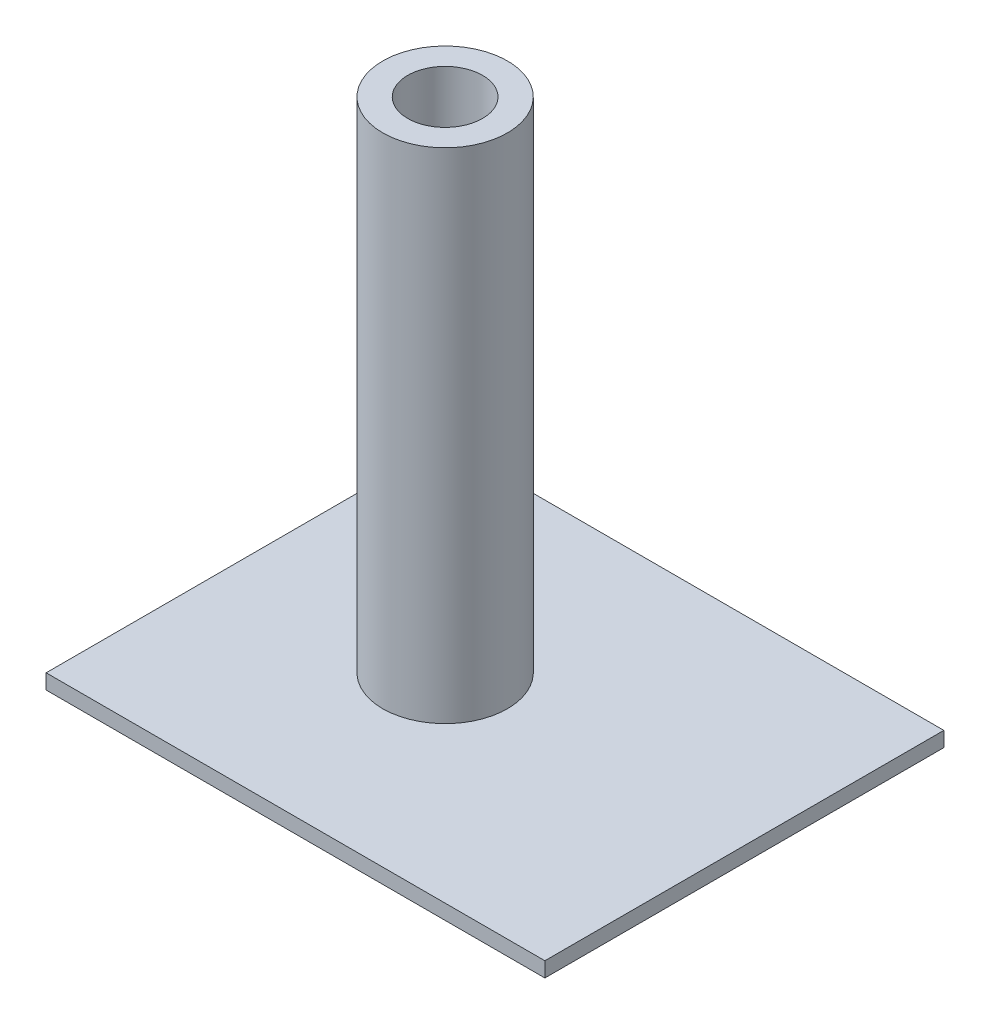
ISO-10303-21;
HEADER;
FILE_DESCRIPTION(('STEP AP214'),'2;1');
FILE_NAME('part.step','',(''),(''),'','','');
FILE_SCHEMA(('AUTOMOTIVE_DESIGN { 1 0 10303 214 1 1 1 1 }'));
ENDSEC;
DATA;
#1=APPLICATION_CONTEXT('core data for automotive mechanical design processes');
#2=APPLICATION_PROTOCOL_DEFINITION('international standard','automotive_design',2000,#1);
#3=PRODUCT_CONTEXT('',#1,'mechanical');
#4=PRODUCT('Part','Part','',(#3));
#5=PRODUCT_RELATED_PRODUCT_CATEGORY('part','',(#4));
#6=PRODUCT_DEFINITION_FORMATION('','',#4);
#7=PRODUCT_DEFINITION_CONTEXT('part definition',#1,'design');
#8=PRODUCT_DEFINITION('design','',#6,#7);
#9=PRODUCT_DEFINITION_SHAPE('','',#8);
#10=(LENGTH_UNIT() NAMED_UNIT(*) SI_UNIT(.MILLI.,.METRE.));
#11=(NAMED_UNIT(*) PLANE_ANGLE_UNIT() SI_UNIT($,.RADIAN.));
#12=(NAMED_UNIT(*) SI_UNIT($,.STERADIAN.) SOLID_ANGLE_UNIT());
#13=UNCERTAINTY_MEASURE_WITH_UNIT(LENGTH_MEASURE(1.E-05),#10,'distance_accuracy_value','');
#14=(GEOMETRIC_REPRESENTATION_CONTEXT(3) GLOBAL_UNCERTAINTY_ASSIGNED_CONTEXT((#13)) GLOBAL_UNIT_ASSIGNED_CONTEXT((#10,
#11,#12)) REPRESENTATION_CONTEXT('',''));
#15=CARTESIAN_POINT('',(0.,0.,0.));
#16=DIRECTION('',(0.,0.,1.));
#17=DIRECTION('',(1.,0.,0.));
#18=AXIS2_PLACEMENT_3D('',#15,#16,#17);
#19=CARTESIAN_POINT('',(0.,0.,0.));
#20=DIRECTION('',(0.,1.,0.));
#21=DIRECTION('',(0.,0.,1.));
#22=AXIS2_PLACEMENT_3D('',#19,#20,#21);
#23=PLANE('',#22);
#24=DIRECTION('',(0.,0.,1.));
#25=VECTOR('',#24,1.);
#26=CARTESIAN_POINT('',(-50.,0.,-40.));
#27=LINE('',#26,#25);
#28=CARTESIAN_POINT('',(-50.,0.,-40.));
#29=VERTEX_POINT('',#28);
#30=CARTESIAN_POINT('',(-50.,0.,40.));
#31=VERTEX_POINT('',#30);
#32=EDGE_CURVE('E108',#29,#31,#27,.T.);
#33=ORIENTED_EDGE('',*,*,#32,.T.);
#34=DIRECTION('',(1.,0.,0.));
#35=VECTOR('',#34,1.);
#36=CARTESIAN_POINT('',(-50.,0.,40.));
#37=LINE('',#36,#35);
#38=CARTESIAN_POINT('',(50.,0.,40.));
#39=VERTEX_POINT('',#38);
#40=EDGE_CURVE('E111',#31,#39,#37,.T.);
#41=ORIENTED_EDGE('',*,*,#40,.T.);
#42=DIRECTION('',(0.,0.,1.));
#43=VECTOR('',#42,1.);
#44=CARTESIAN_POINT('',(50.,0.,-40.));
#45=LINE('',#44,#43);
#46=CARTESIAN_POINT('',(50.,0.,-40.));
#47=VERTEX_POINT('',#46);
#48=EDGE_CURVE('E97',#47,#39,#45,.T.);
#49=ORIENTED_EDGE('',*,*,#48,.F.);
#50=DIRECTION('',(1.,0.,0.));
#51=VECTOR('',#50,1.);
#52=CARTESIAN_POINT('',(-50.,0.,-40.));
#53=LINE('',#52,#51);
#54=EDGE_CURVE('E72',#29,#47,#53,.T.);
#55=ORIENTED_EDGE('',*,*,#54,.F.);
#56=EDGE_LOOP('',(#33,#41,#49,#55));
#57=FACE_BOUND('',#56,.T.);
#58=CARTESIAN_POINT('',(-9.99999999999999,0.,0.));
#59=DIRECTION('',(0.,1.,0.));
#60=DIRECTION('',(0.,0.,1.));
#61=AXIS2_PLACEMENT_3D('',#58,#59,#60);
#62=CIRCLE('',#61,12.5);
#63=CARTESIAN_POINT('',(-9.99999999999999,0.,12.5));
#64=VERTEX_POINT('',#63);
#65=EDGE_CURVE('E124',#64,#64,#62,.T.);
#66=ORIENTED_EDGE('',*,*,#65,.F.);
#67=EDGE_LOOP('',(#66));
#68=FACE_BOUND('',#67,.T.);
#69=ADVANCED_FACE('F39',(#57,#68),#23,.T.);
#70=CARTESIAN_POINT('',(-50.,-3.,-40.));
#71=DIRECTION('',(-1.,0.,0.));
#72=DIRECTION('',(0.,0.,1.));
#73=AXIS2_PLACEMENT_3D('',#70,#71,#72);
#74=PLANE('',#73);
#75=ORIENTED_EDGE('',*,*,#32,.F.);
#76=DIRECTION('',(0.,1.,0.));
#77=VECTOR('',#76,1.);
#78=CARTESIAN_POINT('',(-50.,-3.,-40.));
#79=LINE('',#78,#77);
#80=CARTESIAN_POINT('',(-50.,-3.,-40.));
#81=VERTEX_POINT('',#80);
#82=EDGE_CURVE('E48',#81,#29,#79,.T.);
#83=ORIENTED_EDGE('',*,*,#82,.F.);
#84=DIRECTION('',(0.,0.,1.));
#85=VECTOR('',#84,1.);
#86=CARTESIAN_POINT('',(-50.,-3.,-40.));
#87=LINE('',#86,#85);
#88=CARTESIAN_POINT('',(-50.,-3.,40.));
#89=VERTEX_POINT('',#88);
#90=EDGE_CURVE('E102',#81,#89,#87,.T.);
#91=ORIENTED_EDGE('',*,*,#90,.T.);
#92=DIRECTION('',(0.,1.,0.));
#93=VECTOR('',#92,1.);
#94=CARTESIAN_POINT('',(-50.,-3.,40.));
#95=LINE('',#94,#93);
#96=EDGE_CURVE('E80',#89,#31,#95,.T.);
#97=ORIENTED_EDGE('',*,*,#96,.T.);
#98=EDGE_LOOP('',(#75,#83,#91,#97));
#99=FACE_BOUND('',#98,.T.);
#100=ADVANCED_FACE('F41',(#99),#74,.T.);
#101=CARTESIAN_POINT('',(-50.,-3.,-40.));
#102=DIRECTION('',(0.,0.,1.));
#103=DIRECTION('',(1.,0.,0.));
#104=AXIS2_PLACEMENT_3D('',#101,#102,#103);
#105=PLANE('',#104);
#106=ORIENTED_EDGE('',*,*,#54,.T.);
#107=DIRECTION('',(0.,1.,0.));
#108=VECTOR('',#107,1.);
#109=CARTESIAN_POINT('',(50.,-3.,-40.));
#110=LINE('',#109,#108);
#111=CARTESIAN_POINT('',(50.,-3.,-40.));
#112=VERTEX_POINT('',#111);
#113=EDGE_CURVE('E99',#112,#47,#110,.T.);
#114=ORIENTED_EDGE('',*,*,#113,.F.);
#115=DIRECTION('',(1.,0.,0.));
#116=VECTOR('',#115,1.);
#117=CARTESIAN_POINT('',(-50.,-3.,-40.));
#118=LINE('',#117,#116);
#119=EDGE_CURVE('E90',#81,#112,#118,.T.);
#120=ORIENTED_EDGE('',*,*,#119,.F.);
#121=ORIENTED_EDGE('',*,*,#82,.T.);
#122=EDGE_LOOP('',(#106,#114,#120,#121));
#123=FACE_BOUND('',#122,.T.);
#124=ADVANCED_FACE('F152',(#123),#105,.F.);
#125=CARTESIAN_POINT('',(50.,-3.,-40.));
#126=DIRECTION('',(-1.,0.,0.));
#127=DIRECTION('',(0.,0.,1.));
#128=AXIS2_PLACEMENT_3D('',#125,#126,#127);
#129=PLANE('',#128);
#130=ORIENTED_EDGE('',*,*,#48,.T.);
#131=DIRECTION('',(0.,1.,0.));
#132=VECTOR('',#131,1.);
#133=CARTESIAN_POINT('',(50.,-3.,40.));
#134=LINE('',#133,#132);
#135=CARTESIAN_POINT('',(50.,-3.,40.));
#136=VERTEX_POINT('',#135);
#137=EDGE_CURVE('E94',#136,#39,#134,.T.);
#138=ORIENTED_EDGE('',*,*,#137,.F.);
#139=DIRECTION('',(0.,0.,1.));
#140=VECTOR('',#139,1.);
#141=CARTESIAN_POINT('',(50.,-3.,-40.));
#142=LINE('',#141,#140);
#143=EDGE_CURVE('E85',#112,#136,#142,.T.);
#144=ORIENTED_EDGE('',*,*,#143,.F.);
#145=ORIENTED_EDGE('',*,*,#113,.T.);
#146=EDGE_LOOP('',(#130,#138,#144,#145));
#147=FACE_BOUND('',#146,.T.);
#148=ADVANCED_FACE('F95',(#147),#129,.F.);
#149=CARTESIAN_POINT('',(-50.,-3.,40.));
#150=DIRECTION('',(0.,0.,1.));
#151=DIRECTION('',(1.,0.,0.));
#152=AXIS2_PLACEMENT_3D('',#149,#150,#151);
#153=PLANE('',#152);
#154=ORIENTED_EDGE('',*,*,#40,.F.);
#155=ORIENTED_EDGE('',*,*,#96,.F.);
#156=DIRECTION('',(1.,0.,0.));
#157=VECTOR('',#156,1.);
#158=CARTESIAN_POINT('',(-50.,-3.,40.));
#159=LINE('',#158,#157);
#160=EDGE_CURVE('E89',#89,#136,#159,.T.);
#161=ORIENTED_EDGE('',*,*,#160,.T.);
#162=ORIENTED_EDGE('',*,*,#137,.T.);
#163=EDGE_LOOP('',(#154,#155,#161,#162));
#164=FACE_BOUND('',#163,.T.);
#165=ADVANCED_FACE('F101',(#164),#153,.T.);
#166=CARTESIAN_POINT('',(0.,-3.,0.));
#167=DIRECTION('',(0.,1.,0.));
#168=DIRECTION('',(0.,0.,1.));
#169=AXIS2_PLACEMENT_3D('',#166,#167,#168);
#170=PLANE('',#169);
#171=ORIENTED_EDGE('',*,*,#90,.F.);
#172=ORIENTED_EDGE('',*,*,#119,.T.);
#173=ORIENTED_EDGE('',*,*,#143,.T.);
#174=ORIENTED_EDGE('',*,*,#160,.F.);
#175=EDGE_LOOP('',(#171,#172,#173,#174));
#176=FACE_BOUND('',#175,.T.);
#177=ADVANCED_FACE('F88',(#176),#170,.F.);
#178=CARTESIAN_POINT('',(-9.99999999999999,100.,0.));
#179=DIRECTION('',(0.,1.,0.));
#180=DIRECTION('',(0.,0.,1.));
#181=AXIS2_PLACEMENT_3D('',#178,#179,#180);
#182=PLANE('',#181);
#183=CARTESIAN_POINT('',(-9.99999999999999,100.,0.));
#184=DIRECTION('',(0.,1.,0.));
#185=DIRECTION('',(0.,0.,1.));
#186=AXIS2_PLACEMENT_3D('',#183,#184,#185);
#187=CIRCLE('',#186,12.5);
#188=CARTESIAN_POINT('',(-9.99999999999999,100.,12.5));
#189=VERTEX_POINT('',#188);
#190=EDGE_CURVE('E112',#189,#189,#187,.T.);
#191=ORIENTED_EDGE('',*,*,#190,.T.);
#192=EDGE_LOOP('',(#191));
#193=FACE_BOUND('',#192,.T.);
#194=CARTESIAN_POINT('',(-9.99999999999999,100.,0.));
#195=DIRECTION('',(0.,1.,0.));
#196=DIRECTION('',(1.,0.,0.));
#197=AXIS2_PLACEMENT_3D('',#194,#195,#196);
#198=CIRCLE('',#197,7.5);
#199=CARTESIAN_POINT('',(-2.49999999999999,100.,0.));
#200=VERTEX_POINT('',#199);
#201=EDGE_CURVE('E126',#200,#200,#198,.T.);
#202=ORIENTED_EDGE('',*,*,#201,.F.);
#203=EDGE_LOOP('',(#202));
#204=FACE_BOUND('',#203,.T.);
#205=ADVANCED_FACE('F136',(#193,#204),#182,.T.);
#206=CARTESIAN_POINT('',(-9.99999999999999,100.,0.));
#207=DIRECTION('',(0.,-1.,0.));
#208=DIRECTION('',(0.,0.,-1.));
#209=AXIS2_PLACEMENT_3D('',#206,#207,#208);
#210=CYLINDRICAL_SURFACE('',#209,12.5);
#211=ORIENTED_EDGE('',*,*,#190,.F.);
#212=EDGE_LOOP('',(#211));
#213=FACE_BOUND('',#212,.T.);
#214=ORIENTED_EDGE('',*,*,#65,.T.);
#215=EDGE_LOOP('',(#214));
#216=FACE_BOUND('',#215,.T.);
#217=ADVANCED_FACE('F138',(#213,#216),#210,.T.);
#218=CARTESIAN_POINT('',(-9.99999999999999,100.,0.));
#219=DIRECTION('',(0.,-1.,0.));
#220=DIRECTION('',(0.,0.,-1.));
#221=AXIS2_PLACEMENT_3D('',#218,#219,#220);
#222=CYLINDRICAL_SURFACE('',#221,7.5);
#223=ORIENTED_EDGE('',*,*,#201,.T.);
#224=EDGE_LOOP('',(#223));
#225=FACE_BOUND('',#224,.T.);
#226=CARTESIAN_POINT('',(-9.99999999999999,0.,0.));
#227=DIRECTION('',(0.,1.,0.));
#228=DIRECTION('',(0.,0.,1.));
#229=AXIS2_PLACEMENT_3D('',#226,#227,#228);
#230=CIRCLE('',#229,7.5);
#231=CARTESIAN_POINT('',(-9.99999999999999,0.,7.5));
#232=VERTEX_POINT('',#231);
#233=EDGE_CURVE('E12',#232,#232,#230,.F.);
#234=ORIENTED_EDGE('',*,*,#233,.T.);
#235=EDGE_LOOP('',(#234));
#236=FACE_BOUND('',#235,.T.);
#237=ADVANCED_FACE('F133',(#225,#236),#222,.F.);
#238=ORIENTED_EDGE('',*,*,#233,.F.);
#239=EDGE_LOOP('',(#238));
#240=FACE_BOUND('',#239,.T.);
#241=ADVANCED_FACE('F121',(#240),#23,.T.);
#242=CLOSED_SHELL('',(#69,#100,#124,#148,#165,#177,#205,#217,#237,#241));
#243=MANIFOLD_SOLID_BREP('B2',#242);
#244=ADVANCED_BREP_SHAPE_REPRESENTATION('',(#18,#243),#14);
#245=SHAPE_DEFINITION_REPRESENTATION(#9,#244);
ENDSEC;
END-ISO-10303-21;
